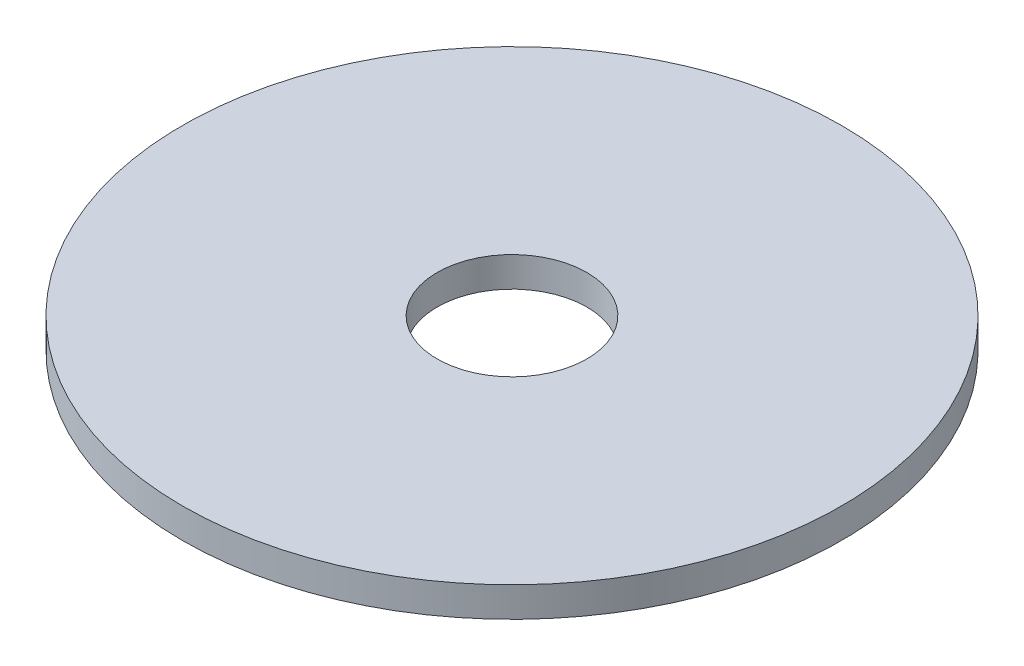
ISO-10303-21;
HEADER;
FILE_DESCRIPTION(('STEP AP214'),'2;1');
FILE_NAME('part.step','',(''),(''),'','','');
FILE_SCHEMA(('AUTOMOTIVE_DESIGN { 1 0 10303 214 1 1 1 1 }'));
ENDSEC;
DATA;
#1=APPLICATION_CONTEXT('core data for automotive mechanical design processes');
#2=APPLICATION_PROTOCOL_DEFINITION('international standard','automotive_design',2000,#1);
#3=PRODUCT_CONTEXT('',#1,'mechanical');
#4=PRODUCT('Part','Part','',(#3));
#5=PRODUCT_RELATED_PRODUCT_CATEGORY('part','',(#4));
#6=PRODUCT_DEFINITION_FORMATION('','',#4);
#7=PRODUCT_DEFINITION_CONTEXT('part definition',#1,'design');
#8=PRODUCT_DEFINITION('design','',#6,#7);
#9=PRODUCT_DEFINITION_SHAPE('','',#8);
#10=(LENGTH_UNIT() NAMED_UNIT(*) SI_UNIT(.MILLI.,.METRE.));
#11=(NAMED_UNIT(*) PLANE_ANGLE_UNIT() SI_UNIT($,.RADIAN.));
#12=(NAMED_UNIT(*) SI_UNIT($,.STERADIAN.) SOLID_ANGLE_UNIT());
#13=UNCERTAINTY_MEASURE_WITH_UNIT(LENGTH_MEASURE(1.E-05),#10,'distance_accuracy_value','');
#14=(GEOMETRIC_REPRESENTATION_CONTEXT(3) GLOBAL_UNCERTAINTY_ASSIGNED_CONTEXT((#13)) GLOBAL_UNIT_ASSIGNED_CONTEXT((#10,
#11,#12)) REPRESENTATION_CONTEXT('',''));
#15=CARTESIAN_POINT('',(0.,0.,0.));
#16=DIRECTION('',(0.,0.,1.));
#17=DIRECTION('',(1.,0.,0.));
#18=AXIS2_PLACEMENT_3D('',#15,#16,#17);
#19=CARTESIAN_POINT('',(0.,0.,0.));
#20=DIRECTION('',(0.,-1.,0.));
#21=DIRECTION('',(0.,0.,-1.));
#22=AXIS2_PLACEMENT_3D('',#19,#20,#21);
#23=CYLINDRICAL_SURFACE('',#22,22.);
#24=CARTESIAN_POINT('',(0.,27.3810059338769,0.));
#25=DIRECTION('',(0.,-1.,0.));
#26=DIRECTION('',(0.,0.,-1.));
#27=AXIS2_PLACEMENT_3D('',#24,#25,#26);
#28=CIRCLE('',#27,22.);
#29=CARTESIAN_POINT('',(0.,27.3810059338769,-22.));
#30=VERTEX_POINT('',#29);
#31=EDGE_CURVE('E10',#30,#30,#28,.T.);
#32=ORIENTED_EDGE('',*,*,#31,.T.);
#33=EDGE_LOOP('',(#32));
#34=FACE_BOUND('',#33,.T.);
#35=CARTESIAN_POINT('',(0.,25.3810059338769,0.));
#36=DIRECTION('',(0.,-1.,0.));
#37=DIRECTION('',(0.,0.,-1.));
#38=AXIS2_PLACEMENT_3D('',#35,#36,#37);
#39=CIRCLE('',#38,22.);
#40=CARTESIAN_POINT('',(0.,25.3810059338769,-22.));
#41=VERTEX_POINT('',#40);
#42=EDGE_CURVE('E54',#41,#41,#39,.T.);
#43=ORIENTED_EDGE('',*,*,#42,.F.);
#44=EDGE_LOOP('',(#43));
#45=FACE_BOUND('',#44,.T.);
#46=ADVANCED_FACE('F37',(#34,#45),#23,.T.);
#47=CARTESIAN_POINT('',(22.,27.3810059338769,0.));
#48=DIRECTION('',(0.,1.,0.));
#49=DIRECTION('',(0.,0.,1.));
#50=AXIS2_PLACEMENT_3D('',#47,#48,#49);
#51=PLANE('',#50);
#52=CARTESIAN_POINT('',(0.,27.3810059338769,0.));
#53=DIRECTION('',(0.,-1.,0.));
#54=DIRECTION('',(0.,0.,-1.));
#55=AXIS2_PLACEMENT_3D('',#52,#53,#54);
#56=CIRCLE('',#55,5.);
#57=CARTESIAN_POINT('',(0.,27.3810059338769,-5.));
#58=VERTEX_POINT('',#57);
#59=EDGE_CURVE('E44',#58,#58,#56,.T.);
#60=ORIENTED_EDGE('',*,*,#59,.T.);
#61=EDGE_LOOP('',(#60));
#62=FACE_BOUND('',#61,.T.);
#63=ORIENTED_EDGE('',*,*,#31,.F.);
#64=EDGE_LOOP('',(#63));
#65=FACE_BOUND('',#64,.T.);
#66=ADVANCED_FACE('F65',(#62,#65),#51,.T.);
#67=CARTESIAN_POINT('',(0.,0.,0.));
#68=DIRECTION('',(0.,-1.,0.));
#69=DIRECTION('',(0.,0.,-1.));
#70=AXIS2_PLACEMENT_3D('',#67,#68,#69);
#71=CYLINDRICAL_SURFACE('',#70,5.);
#72=CARTESIAN_POINT('',(0.,25.3810059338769,0.));
#73=DIRECTION('',(0.,-1.,0.));
#74=DIRECTION('',(0.,0.,-1.));
#75=AXIS2_PLACEMENT_3D('',#72,#73,#74);
#76=CIRCLE('',#75,5.);
#77=CARTESIAN_POINT('',(0.,25.3810059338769,-5.));
#78=VERTEX_POINT('',#77);
#79=EDGE_CURVE('E49',#78,#78,#76,.T.);
#80=ORIENTED_EDGE('',*,*,#79,.T.);
#81=EDGE_LOOP('',(#80));
#82=FACE_BOUND('',#81,.T.);
#83=ORIENTED_EDGE('',*,*,#59,.F.);
#84=EDGE_LOOP('',(#83));
#85=FACE_BOUND('',#84,.T.);
#86=ADVANCED_FACE('F69',(#82,#85),#71,.F.);
#87=CARTESIAN_POINT('',(5.,25.3810059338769,0.));
#88=DIRECTION('',(0.,-1.,0.));
#89=DIRECTION('',(0.,0.,-1.));
#90=AXIS2_PLACEMENT_3D('',#87,#88,#89);
#91=PLANE('',#90);
#92=ORIENTED_EDGE('',*,*,#42,.T.);
#93=EDGE_LOOP('',(#92));
#94=FACE_BOUND('',#93,.T.);
#95=ORIENTED_EDGE('',*,*,#79,.F.);
#96=EDGE_LOOP('',(#95));
#97=FACE_BOUND('',#96,.T.);
#98=ADVANCED_FACE('F61',(#94,#97),#91,.T.);
#99=CLOSED_SHELL('',(#46,#66,#86,#98));
#100=MANIFOLD_SOLID_BREP('B2',#99);
#101=ADVANCED_BREP_SHAPE_REPRESENTATION('',(#18,#100),#14);
#102=SHAPE_DEFINITION_REPRESENTATION(#9,#101);
ENDSEC;
END-ISO-10303-21;
